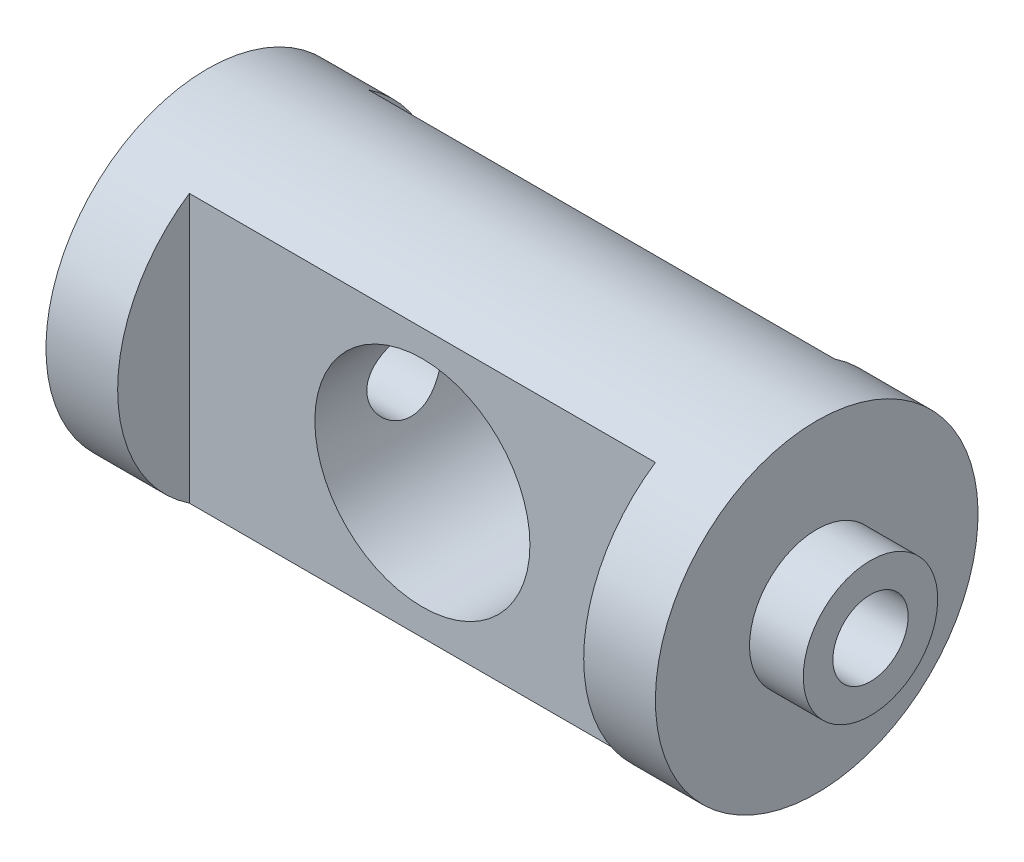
ISO-10303-21;
HEADER;
FILE_DESCRIPTION(('STEP AP214'),'2;1');
FILE_NAME('part.step','',(''),(''),'','','');
FILE_SCHEMA(('AUTOMOTIVE_DESIGN { 1 0 10303 214 1 1 1 1 }'));
ENDSEC;
DATA;
#1=APPLICATION_CONTEXT('core data for automotive mechanical design processes');
#2=APPLICATION_PROTOCOL_DEFINITION('international standard','automotive_design',2000,#1);
#3=PRODUCT_CONTEXT('',#1,'mechanical');
#4=PRODUCT('Part','Part','',(#3));
#5=PRODUCT_RELATED_PRODUCT_CATEGORY('part','',(#4));
#6=PRODUCT_DEFINITION_FORMATION('','',#4);
#7=PRODUCT_DEFINITION_CONTEXT('part definition',#1,'design');
#8=PRODUCT_DEFINITION('design','',#6,#7);
#9=PRODUCT_DEFINITION_SHAPE('','',#8);
#10=(LENGTH_UNIT() NAMED_UNIT(*) SI_UNIT(.MILLI.,.METRE.));
#11=(NAMED_UNIT(*) PLANE_ANGLE_UNIT() SI_UNIT($,.RADIAN.));
#12=(NAMED_UNIT(*) SI_UNIT($,.STERADIAN.) SOLID_ANGLE_UNIT());
#13=UNCERTAINTY_MEASURE_WITH_UNIT(LENGTH_MEASURE(1.E-05),#10,'distance_accuracy_value','');
#14=(GEOMETRIC_REPRESENTATION_CONTEXT(3) GLOBAL_UNCERTAINTY_ASSIGNED_CONTEXT((#13)) GLOBAL_UNIT_ASSIGNED_CONTEXT((#10,
#11,#12)) REPRESENTATION_CONTEXT('',''));
#15=CARTESIAN_POINT('',(0.,0.,0.));
#16=DIRECTION('',(0.,0.,1.));
#17=DIRECTION('',(1.,0.,0.));
#18=AXIS2_PLACEMENT_3D('',#15,#16,#17);
#19=CARTESIAN_POINT('',(40.,0.,0.));
#20=DIRECTION('',(1.,0.,0.));
#21=DIRECTION('',(0.,1.,0.));
#22=AXIS2_PLACEMENT_3D('',#19,#20,#21);
#23=CYLINDRICAL_SURFACE('',#22,8.99999999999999);
#24=DIRECTION('',(1.,0.,0.));
#25=VECTOR('',#24,1.);
#26=CARTESIAN_POINT('',(40.,-7.48331477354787,5.00000000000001));
#27=LINE('',#26,#25);
#28=CARTESIAN_POINT('',(7.,-7.48331477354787,5.00000000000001));
#29=VERTEX_POINT('',#28);
#30=CARTESIAN_POINT('',(33.,-7.48331477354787,5.00000000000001));
#31=VERTEX_POINT('',#30);
#32=EDGE_CURVE('E98',#29,#31,#27,.T.);
#33=ORIENTED_EDGE('',*,*,#32,.F.);
#34=CARTESIAN_POINT('',(7.00000000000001,0.,0.));
#35=DIRECTION('',(-1.,0.,0.));
#36=DIRECTION('',(0.,0.,1.));
#37=AXIS2_PLACEMENT_3D('',#34,#35,#36);
#38=CIRCLE('',#37,8.99999999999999);
#39=CARTESIAN_POINT('',(7.,7.48331477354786,5.00000000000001));
#40=VERTEX_POINT('',#39);
#41=EDGE_CURVE('E128',#40,#29,#38,.F.);
#42=ORIENTED_EDGE('',*,*,#41,.F.);
#43=DIRECTION('',(1.,0.,0.));
#44=VECTOR('',#43,1.);
#45=CARTESIAN_POINT('',(40.,7.48331477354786,5.00000000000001));
#46=LINE('',#45,#44);
#47=CARTESIAN_POINT('',(33.,7.48331477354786,5.00000000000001));
#48=VERTEX_POINT('',#47);
#49=EDGE_CURVE('E58',#48,#40,#46,.F.);
#50=ORIENTED_EDGE('',*,*,#49,.F.);
#51=CARTESIAN_POINT('',(33.,0.,0.));
#52=DIRECTION('',(1.,0.,0.));
#53=DIRECTION('',(0.,0.,-1.));
#54=AXIS2_PLACEMENT_3D('',#51,#52,#53);
#55=CIRCLE('',#54,8.99999999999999);
#56=EDGE_CURVE('E230',#31,#48,#55,.F.);
#57=ORIENTED_EDGE('',*,*,#56,.F.);
#58=EDGE_LOOP('',(#33,#42,#50,#57));
#59=FACE_BOUND('',#58,.T.);
#60=CARTESIAN_POINT('',(3.,0.,0.));
#61=DIRECTION('',(1.,0.,0.));
#62=DIRECTION('',(0.,1.,0.));
#63=AXIS2_PLACEMENT_3D('',#60,#61,#62);
#64=CIRCLE('',#63,8.99999999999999);
#65=CARTESIAN_POINT('',(3.,8.99999999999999,0.));
#66=VERTEX_POINT('',#65);
#67=EDGE_CURVE('E119',#66,#66,#64,.T.);
#68=ORIENTED_EDGE('',*,*,#67,.T.);
#69=EDGE_LOOP('',(#68));
#70=FACE_BOUND('',#69,.T.);
#71=CARTESIAN_POINT('',(37.,0.,0.));
#72=DIRECTION('',(1.,0.,0.));
#73=DIRECTION('',(0.,1.,0.));
#74=AXIS2_PLACEMENT_3D('',#71,#72,#73);
#75=CIRCLE('',#74,8.99999999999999);
#76=CARTESIAN_POINT('',(37.,8.99999999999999,0.));
#77=VERTEX_POINT('',#76);
#78=EDGE_CURVE('E116',#77,#77,#75,.T.);
#79=ORIENTED_EDGE('',*,*,#78,.F.);
#80=EDGE_LOOP('',(#79));
#81=FACE_BOUND('',#80,.T.);
#82=DIRECTION('',(1.,0.,0.));
#83=VECTOR('',#82,1.);
#84=CARTESIAN_POINT('',(40.,7.48331477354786,-5.00000000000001));
#85=LINE('',#84,#83);
#86=CARTESIAN_POINT('',(33.,7.48331477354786,-5.00000000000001));
#87=VERTEX_POINT('',#86);
#88=CARTESIAN_POINT('',(7.,7.48331477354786,-5.00000000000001));
#89=VERTEX_POINT('',#88);
#90=EDGE_CURVE('E85',#87,#89,#85,.F.);
#91=ORIENTED_EDGE('',*,*,#90,.T.);
#92=CARTESIAN_POINT('',(7.00000000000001,0.,0.));
#93=DIRECTION('',(1.,0.,0.));
#94=DIRECTION('',(0.,0.,-1.));
#95=AXIS2_PLACEMENT_3D('',#92,#93,#94);
#96=CIRCLE('',#95,8.99999999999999);
#97=CARTESIAN_POINT('',(7.,-7.48331477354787,-5.00000000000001));
#98=VERTEX_POINT('',#97);
#99=EDGE_CURVE('E11',#89,#98,#96,.F.);
#100=ORIENTED_EDGE('',*,*,#99,.T.);
#101=DIRECTION('',(1.,0.,0.));
#102=VECTOR('',#101,1.);
#103=CARTESIAN_POINT('',(40.,-7.48331477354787,-5.00000000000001));
#104=LINE('',#103,#102);
#105=CARTESIAN_POINT('',(33.,-7.48331477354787,-5.00000000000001));
#106=VERTEX_POINT('',#105);
#107=EDGE_CURVE('E78',#98,#106,#104,.T.);
#108=ORIENTED_EDGE('',*,*,#107,.T.);
#109=CARTESIAN_POINT('',(33.,0.,0.));
#110=DIRECTION('',(-1.,0.,0.));
#111=DIRECTION('',(0.,0.,1.));
#112=AXIS2_PLACEMENT_3D('',#109,#110,#111);
#113=CIRCLE('',#112,8.99999999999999);
#114=EDGE_CURVE('E43',#106,#87,#113,.F.);
#115=ORIENTED_EDGE('',*,*,#114,.T.);
#116=EDGE_LOOP('',(#91,#100,#108,#115));
#117=FACE_BOUND('',#116,.T.);
#118=ADVANCED_FACE('F35',(#59,#70,#81,#117),#23,.T.);
#119=CARTESIAN_POINT('',(20.,0.,-10.));
#120=DIRECTION('',(0.,0.,1.));
#121=DIRECTION('',(1.,0.,0.));
#122=AXIS2_PLACEMENT_3D('',#119,#120,#121);
#123=CYLINDRICAL_SURFACE('',#122,6.);
#124=CARTESIAN_POINT('',(14.,0.,-2.09999999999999));
#125=CARTESIAN_POINT('',(13.9999987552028,-0.114251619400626,-2.10000177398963));
#126=CARTESIAN_POINT('',(14.0032928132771,-0.228490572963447,-2.09064619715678));
#127=CARTESIAN_POINT('',(14.0161072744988,-0.453584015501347,-2.05359972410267));
#128=CARTESIAN_POINT('',(14.0256277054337,-0.564438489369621,-2.0259087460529));
#129=CARTESIAN_POINT('',(14.0498652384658,-0.779485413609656,-1.95327063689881));
#130=CARTESIAN_POINT('',(14.0645731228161,-0.883689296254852,-1.90835410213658));
#131=CARTESIAN_POINT('',(14.0976986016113,-1.0830819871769,-1.80268493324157));
#132=CARTESIAN_POINT('',(14.1161170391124,-1.17826873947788,-1.74192869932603));
#133=CARTESIAN_POINT('',(14.1555162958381,-1.36051553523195,-1.60390289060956));
#134=CARTESIAN_POINT('',(14.1765629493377,-1.44718917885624,-1.52614204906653));
#135=CARTESIAN_POINT('',(14.2184996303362,-1.60656711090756,-1.35735799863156));
#136=CARTESIAN_POINT('',(14.2393896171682,-1.67926788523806,-1.26633146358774));
#137=CARTESIAN_POINT('',(14.2793878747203,-1.8109377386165,-1.07000721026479));
#138=CARTESIAN_POINT('',(14.2984168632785,-1.86938779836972,-0.964343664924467));
#139=CARTESIAN_POINT('',(14.3315285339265,-1.96751959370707,-0.743913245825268));
#140=CARTESIAN_POINT('',(14.345612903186,-2.0072077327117,-0.629149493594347));
#141=CARTESIAN_POINT('',(14.366543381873,-2.0652098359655,-0.398194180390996));
#142=CARTESIAN_POINT('',(14.3736357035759,-2.08425340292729,-0.282208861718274));
#143=CARTESIAN_POINT('',(14.3805045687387,-2.10270718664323,-0.0484889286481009));
#144=CARTESIAN_POINT('',(14.3802836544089,-2.10212422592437,0.0692450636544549));
#145=CARTESIAN_POINT('',(14.3727654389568,-2.08190459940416,0.296729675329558));
#146=CARTESIAN_POINT('',(14.3658300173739,-2.0632422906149,0.406580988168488));
#147=CARTESIAN_POINT('',(14.3462599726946,-2.008991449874,0.621481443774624));
#148=CARTESIAN_POINT('',(14.3336246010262,-1.97340069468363,0.72652995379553));
#149=CARTESIAN_POINT('',(14.3038363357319,-1.88570622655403,0.930967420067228));
#150=CARTESIAN_POINT('',(14.286609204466,-1.83332799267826,1.03022733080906));
#151=CARTESIAN_POINT('',(14.249607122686,-1.71373613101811,1.21884716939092));
#152=CARTESIAN_POINT('',(14.229831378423,-1.64651787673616,1.30820399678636));
#153=CARTESIAN_POINT('',(14.1885605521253,-1.49456039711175,1.47992593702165));
#154=CARTESIAN_POINT('',(14.1670322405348,-1.4090316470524,1.56158594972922));
#155=CARTESIAN_POINT('',(14.1256775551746,-1.22523410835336,1.70959792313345));
#156=CARTESIAN_POINT('',(14.1058513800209,-1.12696383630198,1.77594809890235));
#157=CARTESIAN_POINT('',(14.0698261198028,-0.918860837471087,1.89210359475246));
#158=CARTESIAN_POINT('',(14.0536730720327,-0.808904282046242,1.94170233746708));
#159=CARTESIAN_POINT('',(14.0271507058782,-0.581505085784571,2.02147338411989));
#160=CARTESIAN_POINT('',(14.0167791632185,-0.464065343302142,2.05165315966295));
#161=CARTESIAN_POINT('',(14.0033656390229,-0.230989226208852,2.09043948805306));
#162=CARTESIAN_POINT('',(14.0000006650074,-0.115529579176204,2.09999748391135));
#163=CARTESIAN_POINT('',(13.9999993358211,0.115377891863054,2.10000251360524));
#164=CARTESIAN_POINT('',(14.0033617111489,0.230825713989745,2.09045315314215));
#165=CARTESIAN_POINT('',(14.0162238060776,0.454507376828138,2.0532567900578));
#166=CARTESIAN_POINT('',(14.0255202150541,0.562853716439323,2.02620891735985));
#167=CARTESIAN_POINT('',(14.0491124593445,0.773415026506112,1.95554771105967));
#168=CARTESIAN_POINT('',(14.0634089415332,0.875629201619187,1.91193223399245));
#169=CARTESIAN_POINT('',(14.0960574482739,1.07418407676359,1.80804594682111));
#170=CARTESIAN_POINT('',(14.1145107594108,1.17028394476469,1.74734760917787));
#171=CARTESIAN_POINT('',(14.1533988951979,1.35123467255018,1.61151289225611));
#172=CARTESIAN_POINT('',(14.1738343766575,1.43608178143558,1.53637171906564));
#173=CARTESIAN_POINT('',(14.2156949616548,1.59657189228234,1.36931987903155));
#174=CARTESIAN_POINT('',(14.2371181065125,1.67153670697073,1.2767555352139));
#175=CARTESIAN_POINT('',(14.2775049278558,1.80497245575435,1.07991246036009));
#176=CARTESIAN_POINT('',(14.2964685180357,1.863442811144,0.97563331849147));
#177=CARTESIAN_POINT('',(14.3296366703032,1.96206588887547,0.7579996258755));
#178=CARTESIAN_POINT('',(14.3438411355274,2.00221823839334,0.644644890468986));
#179=CARTESIAN_POINT('',(14.3655947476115,2.06265099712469,0.412160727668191));
#180=CARTESIAN_POINT('',(14.3731473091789,2.08294160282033,0.293034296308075));
#181=CARTESIAN_POINT('',(14.3803276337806,2.10223163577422,0.0596278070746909));
#182=CARTESIAN_POINT('',(14.3803787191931,2.10236838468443,-0.0545461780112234));
#183=CARTESIAN_POINT('',(14.3736120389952,2.08419060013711,-0.28119757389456));
#184=CARTESIAN_POINT('',(14.3667947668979,2.06587739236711,-0.393675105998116));
#185=CARTESIAN_POINT('',(14.3473898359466,2.01215791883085,-0.611130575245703));
#186=CARTESIAN_POINT('',(14.3349392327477,1.97715663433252,-0.71622178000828));
#187=CARTESIAN_POINT('',(14.305733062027,1.89139271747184,-0.919114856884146));
#188=CARTESIAN_POINT('',(14.2889764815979,1.8406263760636,-1.01691500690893));
#189=CARTESIAN_POINT('',(14.2520607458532,1.72198212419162,-1.20746074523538));
#190=CARTESIAN_POINT('',(14.2317782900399,1.65340944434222,-1.29974964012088));
#191=CARTESIAN_POINT('',(14.1905746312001,1.50223440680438,-1.47187657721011));
#192=CARTESIAN_POINT('',(14.1696532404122,1.41962789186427,-1.55171091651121));
#193=CARTESIAN_POINT('',(14.1284079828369,1.23831189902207,-1.70027026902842));
#194=CARTESIAN_POINT('',(14.1081524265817,1.13904838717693,-1.76834067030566));
#195=CARTESIAN_POINT('',(14.0715318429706,0.929800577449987,-1.88677409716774));
#196=CARTESIAN_POINT('',(14.0551663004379,0.819817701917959,-1.93713946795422));
#197=CARTESIAN_POINT('',(14.028342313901,0.593417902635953,-2.0179543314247));
#198=CARTESIAN_POINT('',(14.017821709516,0.477083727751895,-2.04861396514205));
#199=CARTESIAN_POINT('',(14.0036524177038,0.240494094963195,-2.08963229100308));
#200=CARTESIAN_POINT('',(14.0000013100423,0.120240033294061,-2.099998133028));
#201=CARTESIAN_POINT('',(14.,0.,-2.09999999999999));
#202=B_SPLINE_CURVE_WITH_KNOTS('',3,(#124,#125,#126,#127,#128,#129,#130,#131,#132,#133,#134,
#135,#136,#137,#138,#139,#140,#141,#142,#143,#144,#145,#146,#147,#148,#149,#150,#151,#152,#153,
#154,#155,#156,#157,#158,#159,#160,#161,#162,#163,#164,#165,#166,#167,#168,#169,#170,#171,#172,
#173,#174,#175,#176,#177,#178,#179,#180,#181,#182,#183,#184,#185,#186,#187,#188,#189,#190,#191,
#192,#193,#194,#195,#196,#197,#198,#199,#200,#201),.UNSPECIFIED.,.T.,.F.,(4,2,2,2,2,2,2,2,2,2,2,
2,2,2,2,2,2,2,2,2,2,2,2,2,2,2,2,2,2,2,2,2,2,2,2,2,2,2,4),(0.,0.342311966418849,
0.684625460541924,1.0263337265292,1.36811971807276,1.72152774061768,2.07502452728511,
2.4399323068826,2.80471545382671,3.15613820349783,3.5074387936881,3.84080280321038,
4.1742106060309,4.51337542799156,4.85264613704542,5.21157468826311,5.57054506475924,
5.9337930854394,6.29690125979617,6.64286253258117,6.98875852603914,7.32339682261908,
7.65807842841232,8.00202226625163,8.34608046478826,8.70745545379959,9.06884312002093,
9.43023814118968,9.79144753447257,10.1322648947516,10.4730577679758,10.8059714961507,
11.1389636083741,11.4876784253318,11.8364967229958,12.200878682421,12.5652123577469,
12.9255933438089,13.2858473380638),.UNSPECIFIED.);
#203=CARTESIAN_POINT('',(14.,0.,-2.09999999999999));
#204=VERTEX_POINT('',#203);
#205=EDGE_CURVE('E108',#204,#204,#202,.T.);
#206=ORIENTED_EDGE('',*,*,#205,.T.);
#207=EDGE_LOOP('',(#206));
#208=FACE_BOUND('',#207,.T.);
#209=CARTESIAN_POINT('',(26.,0.,-2.09999999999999));
#210=CARTESIAN_POINT('',(26.0000012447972,0.114251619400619,-2.10000177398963));
#211=CARTESIAN_POINT('',(25.9967071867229,0.228490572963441,-2.09064619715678));
#212=CARTESIAN_POINT('',(25.9838927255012,0.453584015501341,-2.05359972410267));
#213=CARTESIAN_POINT('',(25.9743722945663,0.564438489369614,-2.0259087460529));
#214=CARTESIAN_POINT('',(25.9501347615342,0.779485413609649,-1.95327063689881));
#215=CARTESIAN_POINT('',(25.9354268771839,0.883689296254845,-1.90835410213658));
#216=CARTESIAN_POINT('',(25.9023013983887,1.0830819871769,-1.80268493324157));
#217=CARTESIAN_POINT('',(25.8838829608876,1.17826873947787,-1.74192869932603));
#218=CARTESIAN_POINT('',(25.8444837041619,1.36051553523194,-1.60390289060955));
#219=CARTESIAN_POINT('',(25.8234370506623,1.44718917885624,-1.52614204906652));
#220=CARTESIAN_POINT('',(25.7815003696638,1.60656711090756,-1.35735799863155));
#221=CARTESIAN_POINT('',(25.7606103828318,1.67926788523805,-1.26633146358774));
#222=CARTESIAN_POINT('',(25.7206121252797,1.8109377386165,-1.07000721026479));
#223=CARTESIAN_POINT('',(25.7015831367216,1.86938779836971,-0.964343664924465));
#224=CARTESIAN_POINT('',(25.6684714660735,1.96751959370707,-0.743913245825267));
#225=CARTESIAN_POINT('',(25.654387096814,2.00720773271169,-0.629149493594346));
#226=CARTESIAN_POINT('',(25.633456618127,2.06520983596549,-0.398194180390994));
#227=CARTESIAN_POINT('',(25.6263642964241,2.08425340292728,-0.282208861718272));
#228=CARTESIAN_POINT('',(25.6194954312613,2.10270718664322,-0.0484889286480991));
#229=CARTESIAN_POINT('',(25.6197163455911,2.10212422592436,0.0692450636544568));
#230=CARTESIAN_POINT('',(25.6272345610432,2.08190459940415,0.296729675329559));
#231=CARTESIAN_POINT('',(25.6341699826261,2.0632422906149,0.406580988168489));
#232=CARTESIAN_POINT('',(25.6537400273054,2.00899144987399,0.621481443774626));
#233=CARTESIAN_POINT('',(25.6663753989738,1.97340069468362,0.726529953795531));
#234=CARTESIAN_POINT('',(25.6961636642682,1.88570622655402,0.930967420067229));
#235=CARTESIAN_POINT('',(25.713390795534,1.83332799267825,1.03022733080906));
#236=CARTESIAN_POINT('',(25.750392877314,1.7137361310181,1.21884716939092));
#237=CARTESIAN_POINT('',(25.770168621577,1.64651787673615,1.30820399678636));
#238=CARTESIAN_POINT('',(25.8114394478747,1.49456039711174,1.47992593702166));
#239=CARTESIAN_POINT('',(25.8329677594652,1.40903164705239,1.56158594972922));
#240=CARTESIAN_POINT('',(25.8743224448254,1.22523410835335,1.70959792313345));
#241=CARTESIAN_POINT('',(25.8941486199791,1.12696383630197,1.77594809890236));
#242=CARTESIAN_POINT('',(25.9301738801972,0.918860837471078,1.89210359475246));
#243=CARTESIAN_POINT('',(25.9463269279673,0.808904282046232,1.94170233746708));
#244=CARTESIAN_POINT('',(25.9728492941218,0.581505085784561,2.02147338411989));
#245=CARTESIAN_POINT('',(25.9832208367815,0.464065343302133,2.05165315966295));
#246=CARTESIAN_POINT('',(25.9966343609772,0.230989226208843,2.09043948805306));
#247=CARTESIAN_POINT('',(25.9999993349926,0.115529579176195,2.09999748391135));
#248=CARTESIAN_POINT('',(26.0000006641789,-0.115377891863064,2.10000251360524));
#249=CARTESIAN_POINT('',(25.9966382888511,-0.230825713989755,2.09045315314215));
#250=CARTESIAN_POINT('',(25.9837761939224,-0.454507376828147,2.0532567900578));
#251=CARTESIAN_POINT('',(25.9744797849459,-0.562853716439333,2.02620891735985));
#252=CARTESIAN_POINT('',(25.9508875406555,-0.773415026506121,1.95554771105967));
#253=CARTESIAN_POINT('',(25.9365910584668,-0.875629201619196,1.91193223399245));
#254=CARTESIAN_POINT('',(25.9039425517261,-1.0741840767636,1.80804594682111));
#255=CARTESIAN_POINT('',(25.8854892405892,-1.1702839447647,1.74734760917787));
#256=CARTESIAN_POINT('',(25.8466011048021,-1.35123467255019,1.61151289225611));
#257=CARTESIAN_POINT('',(25.8261656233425,-1.43608178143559,1.53637171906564));
#258=CARTESIAN_POINT('',(25.7843050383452,-1.59657189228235,1.36931987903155));
#259=CARTESIAN_POINT('',(25.7628818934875,-1.67153670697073,1.2767555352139));
#260=CARTESIAN_POINT('',(25.7224950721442,-1.80497245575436,1.07991246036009));
#261=CARTESIAN_POINT('',(25.7035314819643,-1.86344281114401,0.975633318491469));
#262=CARTESIAN_POINT('',(25.6703633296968,-1.96206588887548,0.757999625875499));
#263=CARTESIAN_POINT('',(25.6561588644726,-2.00221823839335,0.644644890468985));
#264=CARTESIAN_POINT('',(25.6344052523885,-2.0626509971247,0.41216072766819));
#265=CARTESIAN_POINT('',(25.6268526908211,-2.08294160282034,0.293034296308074));
#266=CARTESIAN_POINT('',(25.6196723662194,-2.10223163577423,0.0596278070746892));
#267=CARTESIAN_POINT('',(25.6196212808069,-2.10236838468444,-0.0545461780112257));
#268=CARTESIAN_POINT('',(25.6263879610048,-2.08419060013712,-0.281197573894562));
#269=CARTESIAN_POINT('',(25.6332052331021,-2.06587739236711,-0.393675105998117));
#270=CARTESIAN_POINT('',(25.6526101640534,-2.01215791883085,-0.611130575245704));
#271=CARTESIAN_POINT('',(25.6650607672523,-1.97715663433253,-0.716221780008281));
#272=CARTESIAN_POINT('',(25.694266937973,-1.89139271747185,-0.919114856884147));
#273=CARTESIAN_POINT('',(25.7110235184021,-1.84062637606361,-1.01691500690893));
#274=CARTESIAN_POINT('',(25.7479392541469,-1.72198212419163,-1.20746074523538));
#275=CARTESIAN_POINT('',(25.7682217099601,-1.65340944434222,-1.29974964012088));
#276=CARTESIAN_POINT('',(25.8094253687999,-1.50223440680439,-1.47187657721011));
#277=CARTESIAN_POINT('',(25.8303467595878,-1.41962789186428,-1.55171091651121));
#278=CARTESIAN_POINT('',(25.8715920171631,-1.23831189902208,-1.70027026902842));
#279=CARTESIAN_POINT('',(25.8918475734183,-1.13904838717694,-1.76834067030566));
#280=CARTESIAN_POINT('',(25.9284681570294,-0.929800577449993,-1.88677409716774));
#281=CARTESIAN_POINT('',(25.9448336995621,-0.819817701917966,-1.93713946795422));
#282=CARTESIAN_POINT('',(25.971657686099,-0.593417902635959,-2.0179543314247));
#283=CARTESIAN_POINT('',(25.982178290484,-0.477083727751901,-2.04861396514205));
#284=CARTESIAN_POINT('',(25.9963475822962,-0.240494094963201,-2.08963229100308));
#285=CARTESIAN_POINT('',(25.9999986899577,-0.120240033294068,-2.099998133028));
#286=CARTESIAN_POINT('',(26.,0.,-2.09999999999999));
#287=B_SPLINE_CURVE_WITH_KNOTS('',3,(#209,#210,#211,#212,#213,#214,#215,#216,#217,#218,#219,
#220,#221,#222,#223,#224,#225,#226,#227,#228,#229,#230,#231,#232,#233,#234,#235,#236,#237,#238,
#239,#240,#241,#242,#243,#244,#245,#246,#247,#248,#249,#250,#251,#252,#253,#254,#255,#256,#257,
#258,#259,#260,#261,#262,#263,#264,#265,#266,#267,#268,#269,#270,#271,#272,#273,#274,#275,#276,
#277,#278,#279,#280,#281,#282,#283,#284,#285,#286),.UNSPECIFIED.,.T.,.F.,(4,2,2,2,2,2,2,2,2,2,2,
2,2,2,2,2,2,2,2,2,2,2,2,2,2,2,2,2,2,2,2,2,2,2,2,2,2,2,4),(0.,0.342311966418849,
0.684625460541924,1.0263337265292,1.36811971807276,1.72152774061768,2.07502452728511,
2.4399323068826,2.80471545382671,3.15613820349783,3.5074387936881,3.84080280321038,
4.1742106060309,4.51337542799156,4.85264613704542,5.21157468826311,5.57054506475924,
5.9337930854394,6.29690125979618,6.64286253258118,6.98875852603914,7.32339682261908,
7.65807842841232,8.00202226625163,8.34608046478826,8.70745545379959,9.06884312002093,
9.43023814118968,9.79144753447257,10.1322648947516,10.4730577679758,10.8059714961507,
11.1389636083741,11.4876784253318,11.8364967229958,12.200878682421,12.5652123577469,
12.925593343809,13.2858473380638),.UNSPECIFIED.);
#288=CARTESIAN_POINT('',(26.,0.,-2.09999999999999));
#289=VERTEX_POINT('',#288);
#290=EDGE_CURVE('E113',#289,#289,#287,.T.);
#291=ORIENTED_EDGE('',*,*,#290,.T.);
#292=EDGE_LOOP('',(#291));
#293=FACE_BOUND('',#292,.T.);
#294=CARTESIAN_POINT('',(20.,0.,5.00000000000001));
#295=DIRECTION('',(0.,0.,-1.));
#296=DIRECTION('',(-1.,0.,0.));
#297=AXIS2_PLACEMENT_3D('',#294,#295,#296);
#298=CIRCLE('',#297,6.);
#299=CARTESIAN_POINT('',(14.,0.,5.00000000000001));
#300=VERTEX_POINT('',#299);
#301=EDGE_CURVE('E96',#300,#300,#298,.F.);
#302=ORIENTED_EDGE('',*,*,#301,.T.);
#303=EDGE_LOOP('',(#302));
#304=FACE_BOUND('',#303,.T.);
#305=CARTESIAN_POINT('',(20.,0.,-5.00000000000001));
#306=DIRECTION('',(0.,0.,-1.));
#307=DIRECTION('',(-1.,0.,0.));
#308=AXIS2_PLACEMENT_3D('',#305,#306,#307);
#309=CIRCLE('',#308,6.);
#310=CARTESIAN_POINT('',(14.,0.,-5.00000000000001));
#311=VERTEX_POINT('',#310);
#312=EDGE_CURVE('E86',#311,#311,#309,.F.);
#313=ORIENTED_EDGE('',*,*,#312,.F.);
#314=EDGE_LOOP('',(#313));
#315=FACE_BOUND('',#314,.T.);
#316=ADVANCED_FACE('F138',(#208,#293,#304,#315),#123,.F.);
#317=CARTESIAN_POINT('',(0.,0.,0.));
#318=DIRECTION('',(-1.,0.,0.));
#319=DIRECTION('',(0.,-1.,0.));
#320=AXIS2_PLACEMENT_3D('',#317,#318,#319);
#321=PLANE('',#320);
#322=CARTESIAN_POINT('',(0.,0.,0.));
#323=DIRECTION('',(1.,0.,0.));
#324=DIRECTION('',(0.,0.,-1.));
#325=AXIS2_PLACEMENT_3D('',#322,#323,#324);
#326=CIRCLE('',#325,2.09999999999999);
#327=CARTESIAN_POINT('',(0.,0.,-2.09999999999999));
#328=VERTEX_POINT('',#327);
#329=EDGE_CURVE('E105',#328,#328,#326,.T.);
#330=ORIENTED_EDGE('',*,*,#329,.T.);
#331=EDGE_LOOP('',(#330));
#332=FACE_BOUND('',#331,.T.);
#333=CARTESIAN_POINT('',(0.,0.,0.));
#334=DIRECTION('',(1.,0.,0.));
#335=DIRECTION('',(0.,1.,0.));
#336=AXIS2_PLACEMENT_3D('',#333,#334,#335);
#337=CIRCLE('',#336,3.74999999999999);
#338=CARTESIAN_POINT('',(0.,3.74999999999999,0.));
#339=VERTEX_POINT('',#338);
#340=EDGE_CURVE('E125',#339,#339,#337,.T.);
#341=ORIENTED_EDGE('',*,*,#340,.F.);
#342=EDGE_LOOP('',(#341));
#343=FACE_BOUND('',#342,.T.);
#344=ADVANCED_FACE('F37',(#332,#343),#321,.T.);
#345=CARTESIAN_POINT('',(40.,0.,0.));
#346=DIRECTION('',(1.,0.,0.));
#347=DIRECTION('',(0.,1.,0.));
#348=AXIS2_PLACEMENT_3D('',#345,#346,#347);
#349=CYLINDRICAL_SURFACE('',#348,3.74999999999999);
#350=ORIENTED_EDGE('',*,*,#340,.T.);
#351=EDGE_LOOP('',(#350));
#352=FACE_BOUND('',#351,.T.);
#353=CARTESIAN_POINT('',(3.,0.,0.));
#354=DIRECTION('',(1.,0.,0.));
#355=DIRECTION('',(0.,1.,0.));
#356=AXIS2_PLACEMENT_3D('',#353,#354,#355);
#357=CIRCLE('',#356,3.74999999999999);
#358=CARTESIAN_POINT('',(3.,3.74999999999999,0.));
#359=VERTEX_POINT('',#358);
#360=EDGE_CURVE('E122',#359,#359,#357,.T.);
#361=ORIENTED_EDGE('',*,*,#360,.F.);
#362=EDGE_LOOP('',(#361));
#363=FACE_BOUND('',#362,.T.);
#364=ADVANCED_FACE('F184',(#352,#363),#349,.T.);
#365=CARTESIAN_POINT('',(3.,3.74999999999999,0.));
#366=DIRECTION('',(-1.,0.,0.));
#367=DIRECTION('',(0.,-1.,0.));
#368=AXIS2_PLACEMENT_3D('',#365,#366,#367);
#369=PLANE('',#368);
#370=ORIENTED_EDGE('',*,*,#360,.T.);
#371=EDGE_LOOP('',(#370));
#372=FACE_BOUND('',#371,.T.);
#373=ORIENTED_EDGE('',*,*,#67,.F.);
#374=EDGE_LOOP('',(#373));
#375=FACE_BOUND('',#374,.T.);
#376=ADVANCED_FACE('F182',(#372,#375),#369,.T.);
#377=CARTESIAN_POINT('',(37.,8.99999999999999,0.));
#378=DIRECTION('',(1.,0.,0.));
#379=DIRECTION('',(0.,1.,0.));
#380=AXIS2_PLACEMENT_3D('',#377,#378,#379);
#381=PLANE('',#380);
#382=ORIENTED_EDGE('',*,*,#78,.T.);
#383=EDGE_LOOP('',(#382));
#384=FACE_BOUND('',#383,.T.);
#385=CARTESIAN_POINT('',(37.,0.,0.));
#386=DIRECTION('',(1.,0.,0.));
#387=DIRECTION('',(0.,1.,0.));
#388=AXIS2_PLACEMENT_3D('',#385,#386,#387);
#389=CIRCLE('',#388,3.74999999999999);
#390=CARTESIAN_POINT('',(37.,3.74999999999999,0.));
#391=VERTEX_POINT('',#390);
#392=EDGE_CURVE('E112',#391,#391,#389,.T.);
#393=ORIENTED_EDGE('',*,*,#392,.F.);
#394=EDGE_LOOP('',(#393));
#395=FACE_BOUND('',#394,.T.);
#396=ADVANCED_FACE('F180',(#384,#395),#381,.T.);
#397=CARTESIAN_POINT('',(40.,0.,0.));
#398=DIRECTION('',(1.,0.,0.));
#399=DIRECTION('',(0.,1.,0.));
#400=AXIS2_PLACEMENT_3D('',#397,#398,#399);
#401=CYLINDRICAL_SURFACE('',#400,3.74999999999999);
#402=ORIENTED_EDGE('',*,*,#392,.T.);
#403=EDGE_LOOP('',(#402));
#404=FACE_BOUND('',#403,.T.);
#405=CARTESIAN_POINT('',(40.,0.,0.));
#406=DIRECTION('',(1.,0.,0.));
#407=DIRECTION('',(0.,1.,0.));
#408=AXIS2_PLACEMENT_3D('',#405,#406,#407);
#409=CIRCLE('',#408,3.74999999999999);
#410=CARTESIAN_POINT('',(40.,3.74999999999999,0.));
#411=VERTEX_POINT('',#410);
#412=EDGE_CURVE('E109',#411,#411,#409,.T.);
#413=ORIENTED_EDGE('',*,*,#412,.F.);
#414=EDGE_LOOP('',(#413));
#415=FACE_BOUND('',#414,.T.);
#416=ADVANCED_FACE('F202',(#404,#415),#401,.T.);
#417=CARTESIAN_POINT('',(40.,3.74999999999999,0.));
#418=DIRECTION('',(1.,0.,0.));
#419=DIRECTION('',(0.,1.,0.));
#420=AXIS2_PLACEMENT_3D('',#417,#418,#419);
#421=PLANE('',#420);
#422=CARTESIAN_POINT('',(40.,0.,0.));
#423=DIRECTION('',(1.,0.,0.));
#424=DIRECTION('',(0.,0.,-1.));
#425=AXIS2_PLACEMENT_3D('',#422,#423,#424);
#426=CIRCLE('',#425,2.09999999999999);
#427=CARTESIAN_POINT('',(40.,0.,-2.09999999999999));
#428=VERTEX_POINT('',#427);
#429=EDGE_CURVE('E102',#428,#428,#426,.T.);
#430=ORIENTED_EDGE('',*,*,#429,.F.);
#431=EDGE_LOOP('',(#430));
#432=FACE_BOUND('',#431,.T.);
#433=ORIENTED_EDGE('',*,*,#412,.T.);
#434=EDGE_LOOP('',(#433));
#435=FACE_BOUND('',#434,.T.);
#436=ADVANCED_FACE('F207',(#432,#435),#421,.T.);
#437=CARTESIAN_POINT('',(40.,0.,0.));
#438=DIRECTION('',(1.,0.,0.));
#439=DIRECTION('',(0.,0.,-1.));
#440=AXIS2_PLACEMENT_3D('',#437,#438,#439);
#441=CYLINDRICAL_SURFACE('',#440,2.09999999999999);
#442=ORIENTED_EDGE('',*,*,#329,.F.);
#443=EDGE_LOOP('',(#442));
#444=FACE_BOUND('',#443,.T.);
#445=ORIENTED_EDGE('',*,*,#205,.F.);
#446=EDGE_LOOP('',(#445));
#447=FACE_BOUND('',#446,.T.);
#448=ADVANCED_FACE('F146',(#444,#447),#441,.F.);
#449=ORIENTED_EDGE('',*,*,#429,.T.);
#450=EDGE_LOOP('',(#449));
#451=FACE_BOUND('',#450,.T.);
#452=ORIENTED_EDGE('',*,*,#290,.F.);
#453=EDGE_LOOP('',(#452));
#454=FACE_BOUND('',#453,.T.);
#455=ADVANCED_FACE('F141',(#451,#454),#441,.F.);
#456=CARTESIAN_POINT('',(7.,-10.,5.00000000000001));
#457=DIRECTION('',(0.,0.,-1.));
#458=DIRECTION('',(-1.,0.,0.));
#459=AXIS2_PLACEMENT_3D('',#456,#457,#458);
#460=PLANE('',#459);
#461=ORIENTED_EDGE('',*,*,#49,.T.);
#462=DIRECTION('',(0.,1.,0.));
#463=VECTOR('',#462,1.);
#464=CARTESIAN_POINT('',(7.,-10.,5.00000000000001));
#465=LINE('',#464,#463);
#466=EDGE_CURVE('E93',#29,#40,#465,.T.);
#467=ORIENTED_EDGE('',*,*,#466,.F.);
#468=ORIENTED_EDGE('',*,*,#32,.T.);
#469=DIRECTION('',(0.,1.,0.));
#470=VECTOR('',#469,1.);
#471=CARTESIAN_POINT('',(33.,-10.,5.00000000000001));
#472=LINE('',#471,#470);
#473=EDGE_CURVE('E91',#31,#48,#472,.T.);
#474=ORIENTED_EDGE('',*,*,#473,.T.);
#475=EDGE_LOOP('',(#461,#467,#468,#474));
#476=FACE_BOUND('',#475,.T.);
#477=ORIENTED_EDGE('',*,*,#301,.F.);
#478=EDGE_LOOP('',(#477));
#479=FACE_BOUND('',#478,.T.);
#480=ADVANCED_FACE('F145',(#476,#479),#460,.F.);
#481=CARTESIAN_POINT('',(7.,-10.,8.99999999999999));
#482=DIRECTION('',(-1.,0.,0.));
#483=DIRECTION('',(0.,0.,1.));
#484=AXIS2_PLACEMENT_3D('',#481,#482,#483);
#485=PLANE('',#484);
#486=ORIENTED_EDGE('',*,*,#41,.T.);
#487=ORIENTED_EDGE('',*,*,#466,.T.);
#488=EDGE_LOOP('',(#486,#487));
#489=FACE_BOUND('',#488,.T.);
#490=ADVANCED_FACE('F148',(#489),#485,.F.);
#491=CARTESIAN_POINT('',(33.,-10.,8.99999999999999));
#492=DIRECTION('',(1.,0.,0.));
#493=DIRECTION('',(0.,0.,-1.));
#494=AXIS2_PLACEMENT_3D('',#491,#492,#493);
#495=PLANE('',#494);
#496=ORIENTED_EDGE('',*,*,#473,.F.);
#497=ORIENTED_EDGE('',*,*,#56,.T.);
#498=EDGE_LOOP('',(#496,#497));
#499=FACE_BOUND('',#498,.T.);
#500=ADVANCED_FACE('F152',(#499),#495,.F.);
#501=CARTESIAN_POINT('',(7.,-10.,-5.00000000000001));
#502=DIRECTION('',(0.,0.,-1.));
#503=DIRECTION('',(-1.,0.,0.));
#504=AXIS2_PLACEMENT_3D('',#501,#502,#503);
#505=PLANE('',#504);
#506=DIRECTION('',(0.,1.,0.));
#507=VECTOR('',#506,1.);
#508=CARTESIAN_POINT('',(33.,-10.,-5.00000000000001));
#509=LINE('',#508,#507);
#510=EDGE_CURVE('E50',#106,#87,#509,.T.);
#511=ORIENTED_EDGE('',*,*,#510,.F.);
#512=ORIENTED_EDGE('',*,*,#107,.F.);
#513=DIRECTION('',(0.,1.,0.));
#514=VECTOR('',#513,1.);
#515=CARTESIAN_POINT('',(7.,-10.,-5.00000000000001));
#516=LINE('',#515,#514);
#517=EDGE_CURVE('E82',#98,#89,#516,.T.);
#518=ORIENTED_EDGE('',*,*,#517,.T.);
#519=ORIENTED_EDGE('',*,*,#90,.F.);
#520=EDGE_LOOP('',(#511,#512,#518,#519));
#521=FACE_BOUND('',#520,.T.);
#522=ORIENTED_EDGE('',*,*,#312,.T.);
#523=EDGE_LOOP('',(#522));
#524=FACE_BOUND('',#523,.T.);
#525=ADVANCED_FACE('F80',(#521,#524),#505,.T.);
#526=CARTESIAN_POINT('',(7.,-10.,-8.99999999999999));
#527=DIRECTION('',(1.,0.,0.));
#528=DIRECTION('',(0.,0.,-1.));
#529=AXIS2_PLACEMENT_3D('',#526,#527,#528);
#530=PLANE('',#529);
#531=ORIENTED_EDGE('',*,*,#99,.F.);
#532=ORIENTED_EDGE('',*,*,#517,.F.);
#533=EDGE_LOOP('',(#531,#532));
#534=FACE_BOUND('',#533,.T.);
#535=ADVANCED_FACE('F89',(#534),#530,.T.);
#536=CARTESIAN_POINT('',(33.,-10.,-8.99999999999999));
#537=DIRECTION('',(-1.,0.,0.));
#538=DIRECTION('',(0.,0.,1.));
#539=AXIS2_PLACEMENT_3D('',#536,#537,#538);
#540=PLANE('',#539);
#541=ORIENTED_EDGE('',*,*,#510,.T.);
#542=ORIENTED_EDGE('',*,*,#114,.F.);
#543=EDGE_LOOP('',(#541,#542));
#544=FACE_BOUND('',#543,.T.);
#545=ADVANCED_FACE('F161',(#544),#540,.T.);
#546=CLOSED_SHELL('',(#118,#316,#344,#364,#376,#396,#416,#436,#448,#455,#480,#490,#500,#525,
#535,#545));
#547=MANIFOLD_SOLID_BREP('B2',#546);
#548=ADVANCED_BREP_SHAPE_REPRESENTATION('',(#18,#547),#14);
#549=SHAPE_DEFINITION_REPRESENTATION(#9,#548);
ENDSEC;
END-ISO-10303-21;
